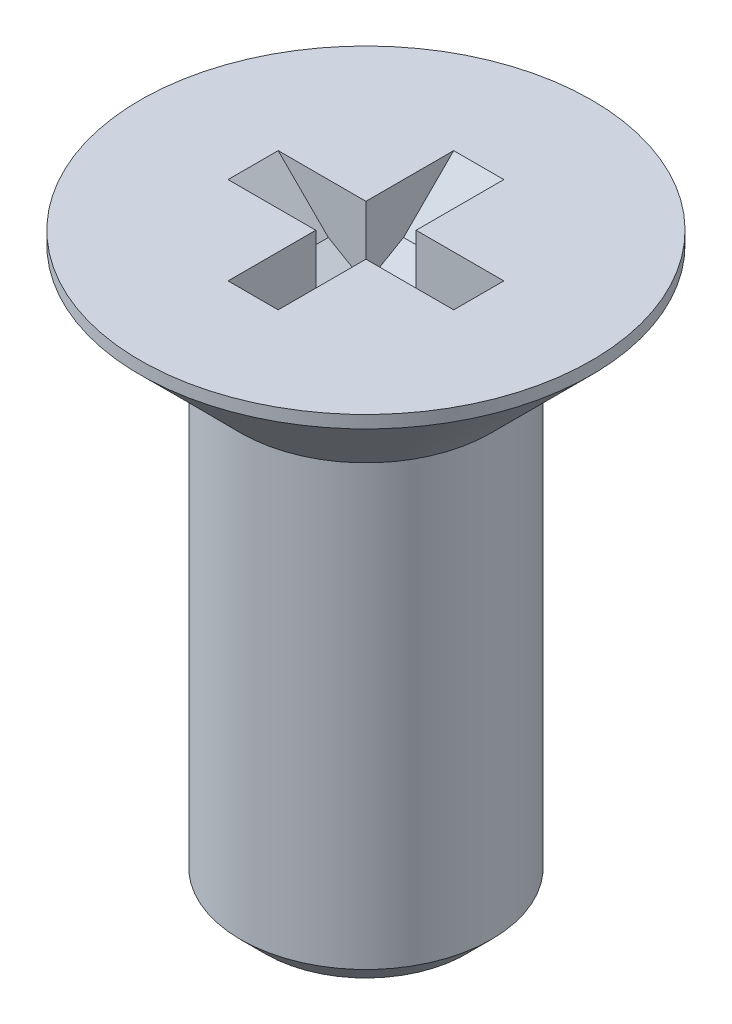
ISO-10303-21;
HEADER;
FILE_DESCRIPTION(('STEP AP214'),'2;1');
FILE_NAME('part.step','',(''),(''),'','','');
FILE_SCHEMA(('AUTOMOTIVE_DESIGN { 1 0 10303 214 1 1 1 1 }'));
ENDSEC;
DATA;
#1=APPLICATION_CONTEXT('core data for automotive mechanical design processes');
#2=APPLICATION_PROTOCOL_DEFINITION('international standard','automotive_design',2000,#1);
#3=PRODUCT_CONTEXT('',#1,'mechanical');
#4=PRODUCT('Part','Part','',(#3));
#5=PRODUCT_RELATED_PRODUCT_CATEGORY('part','',(#4));
#6=PRODUCT_DEFINITION_FORMATION('','',#4);
#7=PRODUCT_DEFINITION_CONTEXT('part definition',#1,'design');
#8=PRODUCT_DEFINITION('design','',#6,#7);
#9=PRODUCT_DEFINITION_SHAPE('','',#8);
#10=(LENGTH_UNIT() NAMED_UNIT(*) SI_UNIT(.MILLI.,.METRE.));
#11=(NAMED_UNIT(*) PLANE_ANGLE_UNIT() SI_UNIT($,.RADIAN.));
#12=(NAMED_UNIT(*) SI_UNIT($,.STERADIAN.) SOLID_ANGLE_UNIT());
#13=UNCERTAINTY_MEASURE_WITH_UNIT(LENGTH_MEASURE(1.E-05),#10,'distance_accuracy_value','');
#14=(GEOMETRIC_REPRESENTATION_CONTEXT(3) GLOBAL_UNCERTAINTY_ASSIGNED_CONTEXT((#13)) GLOBAL_UNIT_ASSIGNED_CONTEXT((#10,
#11,#12)) REPRESENTATION_CONTEXT('',''));
#15=CARTESIAN_POINT('',(0.,0.,0.));
#16=DIRECTION('',(0.,0.,1.));
#17=DIRECTION('',(1.,0.,0.));
#18=AXIS2_PLACEMENT_3D('',#15,#16,#17);
#19=CARTESIAN_POINT('',(-0.2,-0.5732050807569,-0.2));
#20=DIRECTION('',(0.,-1.,0.));
#21=DIRECTION('',(0.,0.,-1.));
#22=AXIS2_PLACEMENT_3D('',#19,#20,#21);
#23=PLANE('',#22);
#24=DIRECTION('',(1.,0.,0.));
#25=VECTOR('',#24,1.);
#26=CARTESIAN_POINT('',(0.2,-0.573205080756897,-0.199999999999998));
#27=LINE('',#26,#25);
#28=CARTESIAN_POINT('',(0.199999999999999,-0.573205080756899,-0.2));
#29=VERTEX_POINT('',#28);
#30=CARTESIAN_POINT('',(-0.2,-0.573205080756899,-0.199999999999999));
#31=VERTEX_POINT('',#30);
#32=EDGE_CURVE('E135',#29,#31,#27,.F.);
#33=ORIENTED_EDGE('',*,*,#32,.T.);
#34=DIRECTION('',(0.,0.,1.));
#35=VECTOR('',#34,1.);
#36=CARTESIAN_POINT('',(-0.199999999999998,-0.573205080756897,-0.2));
#37=LINE('',#36,#35);
#38=CARTESIAN_POINT('',(-0.2,-0.573205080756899,0.199999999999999));
#39=VERTEX_POINT('',#38);
#40=EDGE_CURVE('E116',#31,#39,#37,.T.);
#41=ORIENTED_EDGE('',*,*,#40,.T.);
#42=DIRECTION('',(1.,0.,0.));
#43=VECTOR('',#42,1.);
#44=CARTESIAN_POINT('',(-0.2,-0.573205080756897,0.199999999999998));
#45=LINE('',#44,#43);
#46=CARTESIAN_POINT('',(0.2,-0.573205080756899,0.199999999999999));
#47=VERTEX_POINT('',#46);
#48=EDGE_CURVE('E112',#39,#47,#45,.T.);
#49=ORIENTED_EDGE('',*,*,#48,.T.);
#50=DIRECTION('',(0.,0.,1.));
#51=VECTOR('',#50,1.);
#52=CARTESIAN_POINT('',(0.199999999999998,-0.573205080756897,0.2));
#53=LINE('',#52,#51);
#54=EDGE_CURVE('E137',#47,#29,#53,.F.);
#55=ORIENTED_EDGE('',*,*,#54,.T.);
#56=EDGE_LOOP('',(#33,#41,#49,#55));
#57=FACE_BOUND('',#56,.T.);
#58=ADVANCED_FACE('F17',(#57),#23,.F.);
#59=CARTESIAN_POINT('',(-0.2,-0.4,0.5));
#60=DIRECTION('',(0.,-0.866025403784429,0.500000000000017));
#61=DIRECTION('',(0.,-0.500000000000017,-0.866025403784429));
#62=AXIS2_PLACEMENT_3D('',#59,#60,#61);
#63=PLANE('',#62);
#64=DIRECTION('',(0.,-0.500000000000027,-0.866025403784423));
#65=VECTOR('',#64,1.);
#66=CARTESIAN_POINT('',(0.2,-0.4,0.5));
#67=LINE('',#66,#65);
#68=CARTESIAN_POINT('',(0.2,-0.4,0.5));
#69=VERTEX_POINT('',#68);
#70=EDGE_CURVE('E130',#69,#47,#67,.T.);
#71=ORIENTED_EDGE('',*,*,#70,.T.);
#72=ORIENTED_EDGE('',*,*,#48,.F.);
#73=DIRECTION('',(0.,-0.500000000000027,-0.866025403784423));
#74=VECTOR('',#73,1.);
#75=CARTESIAN_POINT('',(-0.2,-0.4,0.5));
#76=LINE('',#75,#74);
#77=CARTESIAN_POINT('',(-0.2,-0.399999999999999,0.500000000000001));
#78=VERTEX_POINT('',#77);
#79=EDGE_CURVE('E109',#78,#39,#76,.T.);
#80=ORIENTED_EDGE('',*,*,#79,.F.);
#81=DIRECTION('',(1.,0.,0.));
#82=VECTOR('',#81,1.);
#83=CARTESIAN_POINT('',(-0.2,-0.4,0.5));
#84=LINE('',#83,#82);
#85=EDGE_CURVE('E105',#78,#69,#84,.T.);
#86=ORIENTED_EDGE('',*,*,#85,.T.);
#87=EDGE_LOOP('',(#71,#72,#80,#86));
#88=FACE_BOUND('',#87,.T.);
#89=ADVANCED_FACE('F111',(#88),#63,.F.);
#90=CARTESIAN_POINT('',(0.5,-0.4,0.2));
#91=DIRECTION('',(0.500000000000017,-0.866025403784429,0.));
#92=DIRECTION('',(0.866025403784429,0.500000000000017,0.));
#93=AXIS2_PLACEMENT_3D('',#90,#91,#92);
#94=PLANE('',#93);
#95=DIRECTION('',(-0.866025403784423,-0.500000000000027,0.));
#96=VECTOR('',#95,1.);
#97=CARTESIAN_POINT('',(0.5,-0.4,-0.2));
#98=LINE('',#97,#96);
#99=CARTESIAN_POINT('',(0.5,-0.4,-0.2));
#100=VERTEX_POINT('',#99);
#101=EDGE_CURVE('E417',#100,#29,#98,.T.);
#102=ORIENTED_EDGE('',*,*,#101,.T.);
#103=ORIENTED_EDGE('',*,*,#54,.F.);
#104=DIRECTION('',(0.866025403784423,0.500000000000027,0.));
#105=VECTOR('',#104,1.);
#106=CARTESIAN_POINT('',(0.2,-0.5732050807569,0.2));
#107=LINE('',#106,#105);
#108=CARTESIAN_POINT('',(0.499999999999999,-0.400000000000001,0.2));
#109=VERTEX_POINT('',#108);
#110=EDGE_CURVE('E427',#47,#109,#107,.T.);
#111=ORIENTED_EDGE('',*,*,#110,.T.);
#112=DIRECTION('',(0.,0.,1.));
#113=VECTOR('',#112,1.);
#114=CARTESIAN_POINT('',(0.5,-0.4,0.2));
#115=LINE('',#114,#113);
#116=EDGE_CURVE('E422',#109,#100,#115,.F.);
#117=ORIENTED_EDGE('',*,*,#116,.T.);
#118=EDGE_LOOP('',(#102,#103,#111,#117));
#119=FACE_BOUND('',#118,.T.);
#120=ADVANCED_FACE('F343',(#119),#94,.F.);
#121=CARTESIAN_POINT('',(0.2,-0.4,-0.5));
#122=DIRECTION('',(0.,-0.866025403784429,-0.500000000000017));
#123=DIRECTION('',(0.,0.500000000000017,-0.866025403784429));
#124=AXIS2_PLACEMENT_3D('',#121,#122,#123);
#125=PLANE('',#124);
#126=DIRECTION('',(0.,-0.500000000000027,0.866025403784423));
#127=VECTOR('',#126,1.);
#128=CARTESIAN_POINT('',(-0.2,-0.4,-0.5));
#129=LINE('',#128,#127);
#130=CARTESIAN_POINT('',(-0.2,-0.4,-0.5));
#131=VERTEX_POINT('',#130);
#132=EDGE_CURVE('E381',#131,#31,#129,.T.);
#133=ORIENTED_EDGE('',*,*,#132,.T.);
#134=ORIENTED_EDGE('',*,*,#32,.F.);
#135=DIRECTION('',(0.,-0.500000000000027,0.866025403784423));
#136=VECTOR('',#135,1.);
#137=CARTESIAN_POINT('',(0.2,-0.4,-0.5));
#138=LINE('',#137,#136);
#139=CARTESIAN_POINT('',(0.2,-0.399999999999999,-0.500000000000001));
#140=VERTEX_POINT('',#139);
#141=EDGE_CURVE('E414',#140,#29,#138,.T.);
#142=ORIENTED_EDGE('',*,*,#141,.F.);
#143=DIRECTION('',(1.,0.,0.));
#144=VECTOR('',#143,1.);
#145=CARTESIAN_POINT('',(0.2,-0.4,-0.5));
#146=LINE('',#145,#144);
#147=EDGE_CURVE('E383',#140,#131,#146,.F.);
#148=ORIENTED_EDGE('',*,*,#147,.T.);
#149=EDGE_LOOP('',(#133,#134,#142,#148));
#150=FACE_BOUND('',#149,.T.);
#151=ADVANCED_FACE('F333',(#150),#125,.F.);
#152=CARTESIAN_POINT('',(-0.5,-0.4,-0.2));
#153=DIRECTION('',(-0.500000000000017,-0.866025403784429,0.));
#154=DIRECTION('',(0.866025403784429,-0.500000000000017,0.));
#155=AXIS2_PLACEMENT_3D('',#152,#153,#154);
#156=PLANE('',#155);
#157=DIRECTION('',(0.866025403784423,-0.500000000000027,0.));
#158=VECTOR('',#157,1.);
#159=CARTESIAN_POINT('',(-0.5,-0.4,-0.2));
#160=LINE('',#159,#158);
#161=CARTESIAN_POINT('',(-0.500000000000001,-0.399999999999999,-0.2));
#162=VERTEX_POINT('',#161);
#163=EDGE_CURVE('E387',#162,#31,#160,.T.);
#164=ORIENTED_EDGE('',*,*,#163,.F.);
#165=DIRECTION('',(0.,0.,1.));
#166=VECTOR('',#165,1.);
#167=CARTESIAN_POINT('',(-0.5,-0.4,-0.2));
#168=LINE('',#167,#166);
#169=CARTESIAN_POINT('',(-0.5,-0.4,0.2));
#170=VERTEX_POINT('',#169);
#171=EDGE_CURVE('E470',#162,#170,#168,.T.);
#172=ORIENTED_EDGE('',*,*,#171,.T.);
#173=DIRECTION('',(0.866025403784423,-0.500000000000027,0.));
#174=VECTOR('',#173,1.);
#175=CARTESIAN_POINT('',(-0.5,-0.4,0.2));
#176=LINE('',#175,#174);
#177=EDGE_CURVE('E393',#170,#39,#176,.T.);
#178=ORIENTED_EDGE('',*,*,#177,.T.);
#179=ORIENTED_EDGE('',*,*,#40,.F.);
#180=EDGE_LOOP('',(#164,#172,#178,#179));
#181=FACE_BOUND('',#180,.T.);
#182=ADVANCED_FACE('F324',(#181),#156,.F.);
#183=CARTESIAN_POINT('',(-0.2,0.,0.));
#184=DIRECTION('',(1.,0.,0.));
#185=DIRECTION('',(0.,0.,-1.));
#186=AXIS2_PLACEMENT_3D('',#183,#184,#185);
#187=PLANE('',#186);
#188=DIRECTION('',(0.,1.,0.));
#189=VECTOR('',#188,1.);
#190=CARTESIAN_POINT('',(-0.2,0.,0.2));
#191=LINE('',#190,#189);
#192=CARTESIAN_POINT('',(-0.2,0.,0.2));
#193=VERTEX_POINT('',#192);
#194=EDGE_CURVE('E468',#39,#193,#191,.T.);
#195=ORIENTED_EDGE('',*,*,#194,.T.);
#196=DIRECTION('',(0.,0.,-1.));
#197=VECTOR('',#196,1.);
#198=CARTESIAN_POINT('',(-0.2,0.,0.));
#199=LINE('',#198,#197);
#200=CARTESIAN_POINT('',(-0.2,0.,0.9));
#201=VERTEX_POINT('',#200);
#202=EDGE_CURVE('E121',#193,#201,#199,.F.);
#203=ORIENTED_EDGE('',*,*,#202,.T.);
#204=DIRECTION('',(0.,-0.707106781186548,-0.707106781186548));
#205=VECTOR('',#204,1.);
#206=CARTESIAN_POINT('',(-0.2,0.,0.9));
#207=LINE('',#206,#205);
#208=EDGE_CURVE('E115',#201,#78,#207,.T.);
#209=ORIENTED_EDGE('',*,*,#208,.T.);
#210=ORIENTED_EDGE('',*,*,#79,.T.);
#211=EDGE_LOOP('',(#195,#203,#209,#210));
#212=FACE_BOUND('',#211,.T.);
#213=ADVANCED_FACE('F119',(#212),#187,.T.);
#214=CARTESIAN_POINT('',(-0.2,0.,0.9));
#215=DIRECTION('',(0.,-0.707106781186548,0.707106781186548));
#216=DIRECTION('',(0.,-0.707106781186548,-0.707106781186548));
#217=AXIS2_PLACEMENT_3D('',#214,#215,#216);
#218=PLANE('',#217);
#219=ORIENTED_EDGE('',*,*,#85,.F.);
#220=ORIENTED_EDGE('',*,*,#208,.F.);
#221=DIRECTION('',(1.,0.,0.));
#222=VECTOR('',#221,1.);
#223=CARTESIAN_POINT('',(0.,0.,0.9));
#224=LINE('',#223,#222);
#225=CARTESIAN_POINT('',(0.2,0.,0.9));
#226=VERTEX_POINT('',#225);
#227=EDGE_CURVE('E462',#201,#226,#224,.T.);
#228=ORIENTED_EDGE('',*,*,#227,.T.);
#229=DIRECTION('',(0.,-0.707106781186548,-0.707106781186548));
#230=VECTOR('',#229,1.);
#231=CARTESIAN_POINT('',(0.2,0.,0.9));
#232=LINE('',#231,#230);
#233=EDGE_CURVE('E127',#226,#69,#232,.T.);
#234=ORIENTED_EDGE('',*,*,#233,.T.);
#235=EDGE_LOOP('',(#219,#220,#228,#234));
#236=FACE_BOUND('',#235,.T.);
#237=ADVANCED_FACE('F125',(#236),#218,.F.);
#238=CARTESIAN_POINT('',(0.2,0.,0.));
#239=DIRECTION('',(1.,0.,0.));
#240=DIRECTION('',(0.,0.,-1.));
#241=AXIS2_PLACEMENT_3D('',#238,#239,#240);
#242=PLANE('',#241);
#243=ORIENTED_EDGE('',*,*,#70,.F.);
#244=ORIENTED_EDGE('',*,*,#233,.F.);
#245=DIRECTION('',(0.,0.,-1.));
#246=VECTOR('',#245,1.);
#247=CARTESIAN_POINT('',(0.2,0.,0.));
#248=LINE('',#247,#246);
#249=CARTESIAN_POINT('',(0.2,0.,0.2));
#250=VERTEX_POINT('',#249);
#251=EDGE_CURVE('E433',#226,#250,#248,.T.);
#252=ORIENTED_EDGE('',*,*,#251,.T.);
#253=DIRECTION('',(0.,1.,0.));
#254=VECTOR('',#253,1.);
#255=CARTESIAN_POINT('',(0.2,0.,0.2));
#256=LINE('',#255,#254);
#257=EDGE_CURVE('E429',#250,#47,#256,.F.);
#258=ORIENTED_EDGE('',*,*,#257,.T.);
#259=EDGE_LOOP('',(#243,#244,#252,#258));
#260=FACE_BOUND('',#259,.T.);
#261=ADVANCED_FACE('F297',(#260),#242,.F.);
#262=CARTESIAN_POINT('',(0.,0.,0.2));
#263=DIRECTION('',(0.,0.,1.));
#264=DIRECTION('',(1.,0.,0.));
#265=AXIS2_PLACEMENT_3D('',#262,#263,#264);
#266=PLANE('',#265);
#267=DIRECTION('',(0.707106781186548,0.707106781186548,0.));
#268=VECTOR('',#267,1.);
#269=CARTESIAN_POINT('',(0.9,0.,0.2));
#270=LINE('',#269,#268);
#271=CARTESIAN_POINT('',(0.9,0.,0.2));
#272=VERTEX_POINT('',#271);
#273=EDGE_CURVE('E424',#272,#109,#270,.F.);
#274=ORIENTED_EDGE('',*,*,#273,.T.);
#275=ORIENTED_EDGE('',*,*,#110,.F.);
#276=ORIENTED_EDGE('',*,*,#257,.F.);
#277=DIRECTION('',(1.,0.,0.));
#278=VECTOR('',#277,1.);
#279=CARTESIAN_POINT('',(0.,0.,0.2));
#280=LINE('',#279,#278);
#281=EDGE_CURVE('E439',#250,#272,#280,.T.);
#282=ORIENTED_EDGE('',*,*,#281,.T.);
#283=EDGE_LOOP('',(#274,#275,#276,#282));
#284=FACE_BOUND('',#283,.T.);
#285=ADVANCED_FACE('F287',(#284),#266,.F.);
#286=CARTESIAN_POINT('',(0.9,0.,0.2));
#287=DIRECTION('',(0.707106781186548,-0.707106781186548,0.));
#288=DIRECTION('',(0.707106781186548,0.707106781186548,0.));
#289=AXIS2_PLACEMENT_3D('',#286,#287,#288);
#290=PLANE('',#289);
#291=ORIENTED_EDGE('',*,*,#116,.F.);
#292=ORIENTED_EDGE('',*,*,#273,.F.);
#293=DIRECTION('',(0.,0.,-1.));
#294=VECTOR('',#293,1.);
#295=CARTESIAN_POINT('',(0.9,0.,0.));
#296=LINE('',#295,#294);
#297=CARTESIAN_POINT('',(0.9,0.,-0.2));
#298=VERTEX_POINT('',#297);
#299=EDGE_CURVE('E442',#272,#298,#296,.T.);
#300=ORIENTED_EDGE('',*,*,#299,.T.);
#301=DIRECTION('',(-0.707106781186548,-0.707106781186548,0.));
#302=VECTOR('',#301,1.);
#303=CARTESIAN_POINT('',(0.9,0.,-0.2));
#304=LINE('',#303,#302);
#305=EDGE_CURVE('E419',#298,#100,#304,.T.);
#306=ORIENTED_EDGE('',*,*,#305,.T.);
#307=EDGE_LOOP('',(#291,#292,#300,#306));
#308=FACE_BOUND('',#307,.T.);
#309=ADVANCED_FACE('F277',(#308),#290,.F.);
#310=CARTESIAN_POINT('',(0.,0.,-0.2));
#311=DIRECTION('',(0.,0.,-1.));
#312=DIRECTION('',(-1.,0.,0.));
#313=AXIS2_PLACEMENT_3D('',#310,#311,#312);
#314=PLANE('',#313);
#315=ORIENTED_EDGE('',*,*,#101,.F.);
#316=ORIENTED_EDGE('',*,*,#305,.F.);
#317=DIRECTION('',(1.,0.,0.));
#318=VECTOR('',#317,1.);
#319=CARTESIAN_POINT('',(0.,0.,-0.2));
#320=LINE('',#319,#318);
#321=CARTESIAN_POINT('',(0.2,0.,-0.2));
#322=VERTEX_POINT('',#321);
#323=EDGE_CURVE('E444',#298,#322,#320,.F.);
#324=ORIENTED_EDGE('',*,*,#323,.T.);
#325=DIRECTION('',(0.,1.,0.));
#326=VECTOR('',#325,1.);
#327=CARTESIAN_POINT('',(0.2,0.,-0.2));
#328=LINE('',#327,#326);
#329=EDGE_CURVE('E411',#29,#322,#328,.T.);
#330=ORIENTED_EDGE('',*,*,#329,.F.);
#331=EDGE_LOOP('',(#315,#316,#324,#330));
#332=FACE_BOUND('',#331,.T.);
#333=ADVANCED_FACE('F267',(#332),#314,.F.);
#334=CARTESIAN_POINT('',(0.2,0.,0.));
#335=DIRECTION('',(-1.,0.,0.));
#336=DIRECTION('',(0.,0.,1.));
#337=AXIS2_PLACEMENT_3D('',#334,#335,#336);
#338=PLANE('',#337);
#339=ORIENTED_EDGE('',*,*,#141,.T.);
#340=ORIENTED_EDGE('',*,*,#329,.T.);
#341=DIRECTION('',(0.,0.,-1.));
#342=VECTOR('',#341,1.);
#343=CARTESIAN_POINT('',(0.2,0.,0.));
#344=LINE('',#343,#342);
#345=CARTESIAN_POINT('',(0.2,0.,-0.9));
#346=VERTEX_POINT('',#345);
#347=EDGE_CURVE('E447',#322,#346,#344,.T.);
#348=ORIENTED_EDGE('',*,*,#347,.T.);
#349=DIRECTION('',(0.,0.707106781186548,-0.707106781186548));
#350=VECTOR('',#349,1.);
#351=CARTESIAN_POINT('',(0.2,0.,-0.9));
#352=LINE('',#351,#350);
#353=EDGE_CURVE('E408',#346,#140,#352,.F.);
#354=ORIENTED_EDGE('',*,*,#353,.T.);
#355=EDGE_LOOP('',(#339,#340,#348,#354));
#356=FACE_BOUND('',#355,.T.);
#357=ADVANCED_FACE('F257',(#356),#338,.T.);
#358=CARTESIAN_POINT('',(0.2,0.,-0.9));
#359=DIRECTION('',(0.,-0.707106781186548,-0.707106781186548));
#360=DIRECTION('',(0.,0.707106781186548,-0.707106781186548));
#361=AXIS2_PLACEMENT_3D('',#358,#359,#360);
#362=PLANE('',#361);
#363=ORIENTED_EDGE('',*,*,#147,.F.);
#364=ORIENTED_EDGE('',*,*,#353,.F.);
#365=DIRECTION('',(1.,0.,0.));
#366=VECTOR('',#365,1.);
#367=CARTESIAN_POINT('',(0.,0.,-0.9));
#368=LINE('',#367,#366);
#369=CARTESIAN_POINT('',(-0.2,0.,-0.9));
#370=VERTEX_POINT('',#369);
#371=EDGE_CURVE('E449',#346,#370,#368,.F.);
#372=ORIENTED_EDGE('',*,*,#371,.T.);
#373=DIRECTION('',(0.,-0.707106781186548,0.707106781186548));
#374=VECTOR('',#373,1.);
#375=CARTESIAN_POINT('',(-0.2,0.,-0.9));
#376=LINE('',#375,#374);
#377=EDGE_CURVE('E388',#370,#131,#376,.T.);
#378=ORIENTED_EDGE('',*,*,#377,.T.);
#379=EDGE_LOOP('',(#363,#364,#372,#378));
#380=FACE_BOUND('',#379,.T.);
#381=ADVANCED_FACE('F247',(#380),#362,.F.);
#382=CARTESIAN_POINT('',(-0.2,0.,0.));
#383=DIRECTION('',(-1.,0.,0.));
#384=DIRECTION('',(0.,0.,1.));
#385=AXIS2_PLACEMENT_3D('',#382,#383,#384);
#386=PLANE('',#385);
#387=ORIENTED_EDGE('',*,*,#132,.F.);
#388=ORIENTED_EDGE('',*,*,#377,.F.);
#389=DIRECTION('',(0.,0.,-1.));
#390=VECTOR('',#389,1.);
#391=CARTESIAN_POINT('',(-0.2,0.,0.));
#392=LINE('',#391,#390);
#393=CARTESIAN_POINT('',(-0.2,0.,-0.2));
#394=VERTEX_POINT('',#393);
#395=EDGE_CURVE('E398',#370,#394,#392,.F.);
#396=ORIENTED_EDGE('',*,*,#395,.T.);
#397=DIRECTION('',(0.,1.,0.));
#398=VECTOR('',#397,1.);
#399=CARTESIAN_POINT('',(-0.2,0.,-0.2));
#400=LINE('',#399,#398);
#401=EDGE_CURVE('E396',#31,#394,#400,.T.);
#402=ORIENTED_EDGE('',*,*,#401,.F.);
#403=EDGE_LOOP('',(#387,#388,#396,#402));
#404=FACE_BOUND('',#403,.T.);
#405=ADVANCED_FACE('F237',(#404),#386,.F.);
#406=CARTESIAN_POINT('',(0.,0.,-0.2));
#407=DIRECTION('',(0.,0.,1.));
#408=DIRECTION('',(1.,0.,0.));
#409=AXIS2_PLACEMENT_3D('',#406,#407,#408);
#410=PLANE('',#409);
#411=ORIENTED_EDGE('',*,*,#163,.T.);
#412=ORIENTED_EDGE('',*,*,#401,.T.);
#413=DIRECTION('',(1.,0.,0.));
#414=VECTOR('',#413,1.);
#415=CARTESIAN_POINT('',(0.,0.,-0.2));
#416=LINE('',#415,#414);
#417=CARTESIAN_POINT('',(-0.9,0.,-0.2));
#418=VERTEX_POINT('',#417);
#419=EDGE_CURVE('E451',#394,#418,#416,.F.);
#420=ORIENTED_EDGE('',*,*,#419,.T.);
#421=DIRECTION('',(0.707106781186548,-0.707106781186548,0.));
#422=VECTOR('',#421,1.);
#423=CARTESIAN_POINT('',(-0.9,0.,-0.2));
#424=LINE('',#423,#422);
#425=EDGE_CURVE('E400',#418,#162,#424,.T.);
#426=ORIENTED_EDGE('',*,*,#425,.T.);
#427=EDGE_LOOP('',(#411,#412,#420,#426));
#428=FACE_BOUND('',#427,.T.);
#429=ADVANCED_FACE('F228',(#428),#410,.T.);
#430=CARTESIAN_POINT('',(-0.9,0.,-0.2));
#431=DIRECTION('',(-0.707106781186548,-0.707106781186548,0.));
#432=DIRECTION('',(0.707106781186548,-0.707106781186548,0.));
#433=AXIS2_PLACEMENT_3D('',#430,#431,#432);
#434=PLANE('',#433);
#435=ORIENTED_EDGE('',*,*,#171,.F.);
#436=ORIENTED_EDGE('',*,*,#425,.F.);
#437=DIRECTION('',(0.,0.,-1.));
#438=VECTOR('',#437,1.);
#439=CARTESIAN_POINT('',(-0.9,0.,0.));
#440=LINE('',#439,#438);
#441=CARTESIAN_POINT('',(-0.9,0.,0.2));
#442=VERTEX_POINT('',#441);
#443=EDGE_CURVE('E35',#418,#442,#440,.F.);
#444=ORIENTED_EDGE('',*,*,#443,.T.);
#445=DIRECTION('',(0.707106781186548,-0.707106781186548,0.));
#446=VECTOR('',#445,1.);
#447=CARTESIAN_POINT('',(-0.9,0.,0.2));
#448=LINE('',#447,#446);
#449=EDGE_CURVE('E466',#442,#170,#448,.T.);
#450=ORIENTED_EDGE('',*,*,#449,.T.);
#451=EDGE_LOOP('',(#435,#436,#444,#450));
#452=FACE_BOUND('',#451,.T.);
#453=ADVANCED_FACE('F218',(#452),#434,.F.);
#454=CARTESIAN_POINT('',(0.,0.,0.2));
#455=DIRECTION('',(0.,0.,1.));
#456=DIRECTION('',(1.,0.,0.));
#457=AXIS2_PLACEMENT_3D('',#454,#455,#456);
#458=PLANE('',#457);
#459=ORIENTED_EDGE('',*,*,#449,.F.);
#460=DIRECTION('',(1.,0.,0.));
#461=VECTOR('',#460,1.);
#462=CARTESIAN_POINT('',(0.,0.,0.2));
#463=LINE('',#462,#461);
#464=EDGE_CURVE('E473',#442,#193,#463,.T.);
#465=ORIENTED_EDGE('',*,*,#464,.T.);
#466=ORIENTED_EDGE('',*,*,#194,.F.);
#467=ORIENTED_EDGE('',*,*,#177,.F.);
#468=EDGE_LOOP('',(#459,#465,#466,#467));
#469=FACE_BOUND('',#468,.T.);
#470=ADVANCED_FACE('F208',(#469),#458,.F.);
#471=CARTESIAN_POINT('',(0.,0.,0.));
#472=DIRECTION('',(0.,-1.,0.));
#473=DIRECTION('',(0.,0.,-1.));
#474=AXIS2_PLACEMENT_3D('',#471,#472,#473);
#475=PLANE('',#474);
#476=ORIENTED_EDGE('',*,*,#443,.F.);
#477=ORIENTED_EDGE('',*,*,#419,.F.);
#478=ORIENTED_EDGE('',*,*,#395,.F.);
#479=ORIENTED_EDGE('',*,*,#371,.F.);
#480=ORIENTED_EDGE('',*,*,#347,.F.);
#481=ORIENTED_EDGE('',*,*,#323,.F.);
#482=ORIENTED_EDGE('',*,*,#299,.F.);
#483=ORIENTED_EDGE('',*,*,#281,.F.);
#484=ORIENTED_EDGE('',*,*,#251,.F.);
#485=ORIENTED_EDGE('',*,*,#227,.F.);
#486=ORIENTED_EDGE('',*,*,#202,.F.);
#487=ORIENTED_EDGE('',*,*,#464,.F.);
#488=EDGE_LOOP('',(#476,#477,#478,#479,#480,#481,#482,#483,#484,#485,#486,#487));
#489=FACE_BOUND('',#488,.T.);
#490=CARTESIAN_POINT('',(0.,0.,0.));
#491=DIRECTION('',(0.,-1.,0.));
#492=DIRECTION('',(0.,0.,-1.));
#493=AXIS2_PLACEMENT_3D('',#490,#491,#492);
#494=CIRCLE('',#493,1.8);
#495=CARTESIAN_POINT('',(0.,0.,-1.8));
#496=VERTEX_POINT('',#495);
#497=EDGE_CURVE('E20',#496,#496,#494,.T.);
#498=ORIENTED_EDGE('',*,*,#497,.F.);
#499=EDGE_LOOP('',(#498));
#500=FACE_BOUND('',#499,.T.);
#501=ADVANCED_FACE('F163',(#489,#500),#475,.F.);
#502=CARTESIAN_POINT('',(0.,0.53,0.));
#503=DIRECTION('',(0.,-1.,0.));
#504=DIRECTION('',(0.,0.,-1.));
#505=AXIS2_PLACEMENT_3D('',#502,#503,#504);
#506=CYLINDRICAL_SURFACE('',#505,1.8);
#507=ORIENTED_EDGE('',*,*,#497,.T.);
#508=EDGE_LOOP('',(#507));
#509=FACE_BOUND('',#508,.T.);
#510=CARTESIAN_POINT('',(0.,-0.0999999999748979,0.));
#511=DIRECTION('',(0.,1.,0.));
#512=DIRECTION('',(0.,0.,-1.));
#513=AXIS2_PLACEMENT_3D('',#510,#511,#512);
#514=CIRCLE('',#513,1.80000000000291);
#515=CARTESIAN_POINT('',(0.,-0.0999999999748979,-1.80000000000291));
#516=VERTEX_POINT('',#515);
#517=EDGE_CURVE('E140',#516,#516,#514,.F.);
#518=ORIENTED_EDGE('',*,*,#517,.F.);
#519=EDGE_LOOP('',(#518));
#520=FACE_BOUND('',#519,.T.);
#521=ADVANCED_FACE('F154',(#509,#520),#506,.T.);
#522=CARTESIAN_POINT('',(0.,-4.6,0.));
#523=DIRECTION('',(0.,-1.,0.));
#524=DIRECTION('',(0.,0.,-1.));
#525=AXIS2_PLACEMENT_3D('',#522,#523,#524);
#526=PLANE('',#525);
#527=CARTESIAN_POINT('',(0.,-4.59999999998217,0.));
#528=DIRECTION('',(0.,1.,0.));
#529=DIRECTION('',(0.,0.,1.));
#530=AXIS2_PLACEMENT_3D('',#527,#528,#529);
#531=CIRCLE('',#530,0.800000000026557);
#532=CARTESIAN_POINT('',(0.,-4.59999999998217,0.800000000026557));
#533=VERTEX_POINT('',#532);
#534=EDGE_CURVE('E143',#533,#533,#531,.T.);
#535=ORIENTED_EDGE('',*,*,#534,.F.);
#536=EDGE_LOOP('',(#535));
#537=FACE_BOUND('',#536,.T.);
#538=ADVANCED_FACE('F151',(#537),#526,.T.);
#539=CARTESIAN_POINT('',(0.,-0.100000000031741,0.));
#540=DIRECTION('',(0.,1.,0.));
#541=DIRECTION('',(0.,0.,1.));
#542=AXIS2_PLACEMENT_3D('',#539,#540,#541);
#543=CONICAL_SURFACE('',#542,1.79999999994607,0.785398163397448);
#544=ORIENTED_EDGE('',*,*,#517,.T.);
#545=EDGE_LOOP('',(#544));
#546=FACE_BOUND('',#545,.T.);
#547=CARTESIAN_POINT('',(0.,-0.8999999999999,0.));
#548=DIRECTION('',(0.,-1.,0.));
#549=DIRECTION('',(0.,0.,-1.));
#550=AXIS2_PLACEMENT_3D('',#547,#548,#549);
#551=CIRCLE('',#550,1.);
#552=CARTESIAN_POINT('',(0.,-0.8999999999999,-1.));
#553=VERTEX_POINT('',#552);
#554=EDGE_CURVE('E26',#553,#553,#551,.T.);
#555=ORIENTED_EDGE('',*,*,#554,.F.);
#556=EDGE_LOOP('',(#555));
#557=FACE_BOUND('',#556,.T.);
#558=ADVANCED_FACE('F153',(#546,#557),#543,.T.);
#559=CARTESIAN_POINT('',(0.,-4.40000000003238,0.));
#560=DIRECTION('',(0.,1.,0.));
#561=DIRECTION('',(0.,0.,1.));
#562=AXIS2_PLACEMENT_3D('',#559,#560,#561);
#563=CONICAL_SURFACE('',#562,0.999999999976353,0.785398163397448);
#564=ORIENTED_EDGE('',*,*,#534,.T.);
#565=EDGE_LOOP('',(#564));
#566=FACE_BOUND('',#565,.T.);
#567=CARTESIAN_POINT('',(0.,-4.4,0.));
#568=DIRECTION('',(0.,-1.,0.));
#569=DIRECTION('',(0.,0.,-1.));
#570=AXIS2_PLACEMENT_3D('',#567,#568,#569);
#571=CIRCLE('',#570,1.);
#572=CARTESIAN_POINT('',(0.,-4.4,-1.));
#573=VERTEX_POINT('',#572);
#574=EDGE_CURVE('E11',#573,#573,#571,.F.);
#575=ORIENTED_EDGE('',*,*,#574,.F.);
#576=EDGE_LOOP('',(#575));
#577=FACE_BOUND('',#576,.T.);
#578=ADVANCED_FACE('F148',(#566,#577),#563,.T.);
#579=CARTESIAN_POINT('',(0.,0.53,0.));
#580=DIRECTION('',(0.,-1.,0.));
#581=DIRECTION('',(0.,0.,-1.));
#582=AXIS2_PLACEMENT_3D('',#579,#580,#581);
#583=CYLINDRICAL_SURFACE('',#582,1.);
#584=ORIENTED_EDGE('',*,*,#574,.T.);
#585=EDGE_LOOP('',(#584));
#586=FACE_BOUND('',#585,.T.);
#587=ORIENTED_EDGE('',*,*,#554,.T.);
#588=EDGE_LOOP('',(#587));
#589=FACE_BOUND('',#588,.T.);
#590=ADVANCED_FACE('F166',(#586,#589),#583,.T.);
#591=CLOSED_SHELL('',(#58,#89,#120,#151,#182,#213,#237,#261,#285,#309,#333,#357,#381,#405,#429,
#453,#470,#501,#521,#538,#558,#578,#590));
#592=MANIFOLD_SOLID_BREP('B1',#591);
#593=ADVANCED_BREP_SHAPE_REPRESENTATION('',(#18,#592),#14);
#594=SHAPE_DEFINITION_REPRESENTATION(#9,#593);
ENDSEC;
END-ISO-10303-21;
